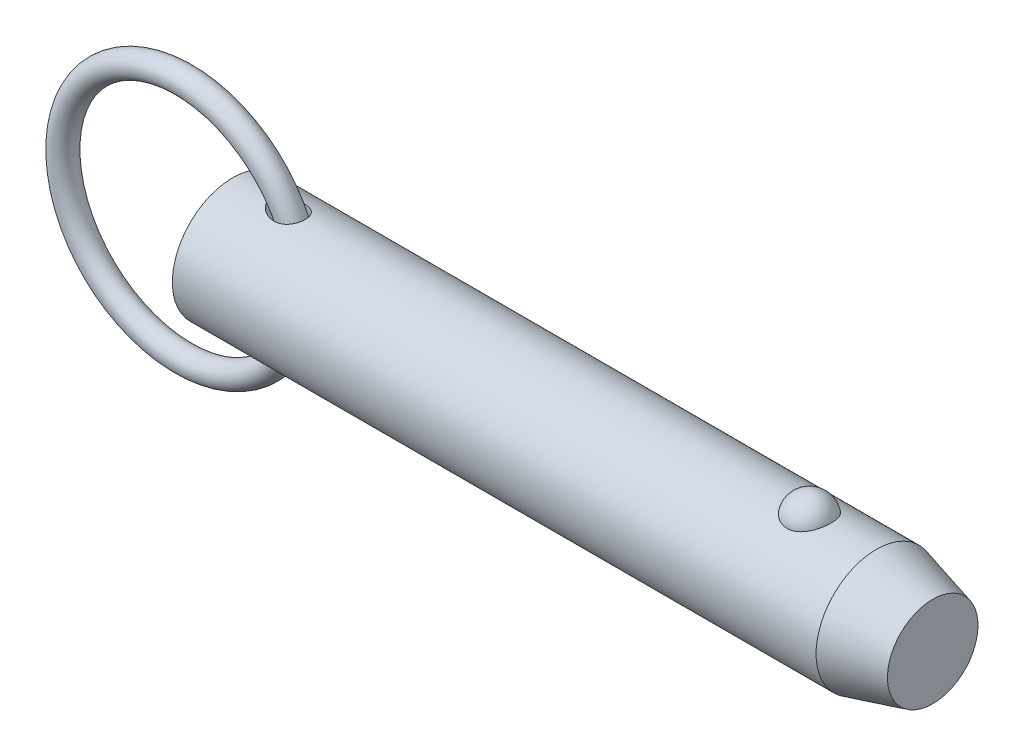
ISO-10303-21;
HEADER;
FILE_DESCRIPTION(('STEP AP214'),'2;1');
FILE_NAME('part.step','',(''),(''),'','','');
FILE_SCHEMA(('AUTOMOTIVE_DESIGN { 1 0 10303 214 1 1 1 1 }'));
ENDSEC;
DATA;
#1=APPLICATION_CONTEXT('core data for automotive mechanical design processes');
#2=APPLICATION_PROTOCOL_DEFINITION('international standard','automotive_design',2000,#1);
#3=PRODUCT_CONTEXT('',#1,'mechanical');
#4=PRODUCT('Part','Part','',(#3));
#5=PRODUCT_RELATED_PRODUCT_CATEGORY('part','',(#4));
#6=PRODUCT_DEFINITION_FORMATION('','',#4);
#7=PRODUCT_DEFINITION_CONTEXT('part definition',#1,'design');
#8=PRODUCT_DEFINITION('design','',#6,#7);
#9=PRODUCT_DEFINITION_SHAPE('','',#8);
#10=(LENGTH_UNIT() NAMED_UNIT(*) SI_UNIT(.MILLI.,.METRE.));
#11=(NAMED_UNIT(*) PLANE_ANGLE_UNIT() SI_UNIT($,.RADIAN.));
#12=(NAMED_UNIT(*) SI_UNIT($,.STERADIAN.) SOLID_ANGLE_UNIT());
#13=UNCERTAINTY_MEASURE_WITH_UNIT(LENGTH_MEASURE(1.E-05),#10,'distance_accuracy_value','');
#14=(GEOMETRIC_REPRESENTATION_CONTEXT(3) GLOBAL_UNCERTAINTY_ASSIGNED_CONTEXT((#13)) GLOBAL_UNIT_ASSIGNED_CONTEXT((#10,
#11,#12)) REPRESENTATION_CONTEXT('',''));
#15=CARTESIAN_POINT('',(0.,0.,0.));
#16=DIRECTION('',(0.,0.,1.));
#17=DIRECTION('',(1.,0.,0.));
#18=AXIS2_PLACEMENT_3D('',#15,#16,#17);
#19=CARTESIAN_POINT('',(-6.46799987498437,0.,0.));
#20=DIRECTION('',(0.,0.,1.));
#21=DIRECTION('',(1.,0.,0.));
#22=AXIS2_PLACEMENT_3D('',#19,#20,#21);
#23=TOROIDAL_SURFACE('',#22,15.875,1.588);
#24=CARTESIAN_POINT('',(10.9950001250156,0.,0.));
#25=VERTEX_POINT('',#24);
#26=VERTEX_LOOP('',#25);
#27=FACE_BOUND('',#26,.T.);
#28=ADVANCED_FACE('P0_F12',(#27),#23,.T.);
#29=CLOSED_SHELL('',(#28));
#30=MANIFOLD_SOLID_BREP('P0_B1',#29);
#31=CARTESIAN_POINT('',(0.,0.,0.));
#32=DIRECTION('',(1.,0.,0.));
#33=DIRECTION('',(0.,0.,-1.));
#34=AXIS2_PLACEMENT_3D('',#31,#32,#33);
#35=CYLINDRICAL_SURFACE('',#34,7.94);
#36=CARTESIAN_POINT('',(5.37881269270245,7.8641200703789,-1.0950869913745));
#37=CARTESIAN_POINT('',(5.49078530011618,7.84653010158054,-1.22142628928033));
#38=CARTESIAN_POINT('',(5.61742164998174,7.82766483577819,-1.33478448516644));
#39=CARTESIAN_POINT('',(5.82155225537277,7.80005811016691,-1.48501770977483));
#40=CARTESIAN_POINT('',(5.89211597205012,7.79095331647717,-1.53186949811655));
#41=CARTESIAN_POINT('',(6.03726296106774,7.77331484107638,-1.61899652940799));
#42=CARTESIAN_POINT('',(6.11184478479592,7.76478095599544,-1.65927412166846));
#43=CARTESIAN_POINT('',(6.31831542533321,7.74290334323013,-1.75933205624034));
#44=CARTESIAN_POINT('',(6.45343253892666,7.73042593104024,-1.81276183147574));
#45=CARTESIAN_POINT('',(6.73017339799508,7.70966096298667,-1.89912673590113));
#46=CARTESIAN_POINT('',(6.8717909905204,7.70136953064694,-1.93208083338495));
#47=CARTESIAN_POINT('',(7.17522096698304,7.6896684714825,-1.97820987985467));
#48=CARTESIAN_POINT('',(7.33750100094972,7.68691980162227,-1.98871513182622));
#49=CARTESIAN_POINT('',(7.5799424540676,7.68880305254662,-1.98137951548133));
#50=CARTESIAN_POINT('',(7.66059155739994,7.69043175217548,-1.97508575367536));
#51=CARTESIAN_POINT('',(7.82077465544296,7.69570110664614,-1.95445819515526));
#52=CARTESIAN_POINT('',(7.9003091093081,7.69934090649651,-1.94012781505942));
#53=CARTESIAN_POINT('',(8.09280087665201,7.71066069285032,-1.89475688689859));
#54=CARTESIAN_POINT('',(8.20465204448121,7.71942251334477,-1.85909462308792));
#55=CARTESIAN_POINT('',(8.42059371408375,7.74035594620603,-1.7699066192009));
#56=CARTESIAN_POINT('',(8.52468939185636,7.75252525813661,-1.7163929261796));
#57=CARTESIAN_POINT('',(8.72211003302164,7.77903750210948,-1.59192358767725));
#58=CARTESIAN_POINT('',(8.81539818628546,7.79338749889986,-1.52091076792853));
#59=CARTESIAN_POINT('',(8.98759177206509,7.8225086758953,-1.36321590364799));
#60=CARTESIAN_POINT('',(9.06649712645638,7.83727985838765,-1.27653377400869));
#61=CARTESIAN_POINT('',(9.20311499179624,7.86453692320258,-1.09567667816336));
#62=CARTESIAN_POINT('',(9.26180839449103,7.8771064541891,-1.00225329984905));
#63=CARTESIAN_POINT('',(9.36257622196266,7.89954213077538,-0.806547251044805));
#64=CARTESIAN_POINT('',(9.40465301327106,7.9094086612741,-0.704265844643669));
#65=CARTESIAN_POINT('',(9.47062404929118,7.92520709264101,-0.495461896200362));
#66=CARTESIAN_POINT('',(9.4947881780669,7.9311972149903,-0.389028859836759));
#67=CARTESIAN_POINT('',(9.52544004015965,7.93883641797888,-0.173494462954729));
#68=CARTESIAN_POINT('',(9.53192786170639,7.94048552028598,-0.0643931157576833));
#69=CARTESIAN_POINT('',(9.52707996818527,7.93926454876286,0.153487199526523));
#70=CARTESIAN_POINT('',(9.51572796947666,7.93639034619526,0.262265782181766));
#71=CARTESIAN_POINT('',(9.47542322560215,7.92642470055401,0.47631311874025));
#72=CARTESIAN_POINT('',(9.44647056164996,7.91933327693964,0.581581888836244));
#73=CARTESIAN_POINT('',(9.3716401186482,7.90170355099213,0.78560269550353));
#74=CARTESIAN_POINT('',(9.32576415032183,7.89116561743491,0.884355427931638));
#75=CARTESIAN_POINT('',(9.21823065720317,7.8677977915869,1.07254831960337));
#76=CARTESIAN_POINT('',(9.15657431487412,7.85496807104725,1.16198917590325));
#77=CARTESIAN_POINT('',(9.01919194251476,7.82843688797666,1.32903649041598));
#78=CARTESIAN_POINT('',(8.94347744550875,7.81473614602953,1.40665255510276));
#79=CARTESIAN_POINT('',(8.78012086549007,7.7879321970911,1.54819779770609));
#80=CARTESIAN_POINT('',(8.69247914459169,7.77482897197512,1.61212739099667));
#81=CARTESIAN_POINT('',(8.50642314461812,7.75037063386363,1.72592270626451));
#82=CARTESIAN_POINT('',(8.40786430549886,7.73904540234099,1.77555777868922));
#83=CARTESIAN_POINT('',(8.2039870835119,7.71943979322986,1.85894844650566));
#84=CARTESIAN_POINT('',(8.0986670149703,7.7111601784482,1.89270006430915));
#85=CARTESIAN_POINT('',(7.87703213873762,7.69782475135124,1.94625652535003));
#86=CARTESIAN_POINT('',(7.76044899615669,7.69301557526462,1.96500324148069));
#87=CARTESIAN_POINT('',(7.52574256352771,7.68770484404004,1.98567257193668));
#88=CARTESIAN_POINT('',(7.40761868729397,7.68720497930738,1.98758858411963));
#89=CARTESIAN_POINT('',(7.15639592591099,7.69044495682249,1.97502233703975));
#90=CARTESIAN_POINT('',(7.02341871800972,7.69476380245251,1.9583009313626));
#91=CARTESIAN_POINT('',(6.7612589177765,7.70776394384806,1.90648094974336));
#92=CARTESIAN_POINT('',(6.6320804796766,7.71644984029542,1.87136299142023));
#93=CARTESIAN_POINT('',(6.35978215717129,7.73875442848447,1.7770773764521));
#94=CARTESIAN_POINT('',(6.21772122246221,7.75293863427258,1.71496895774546));
#95=CARTESIAN_POINT('',(5.94559201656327,7.78383102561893,1.56880760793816));
#96=CARTESIAN_POINT('',(5.81552062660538,7.80053855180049,1.48476040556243));
#97=CARTESIAN_POINT('',(5.60081087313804,7.83035955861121,1.31701356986));
#98=CARTESIAN_POINT('',(5.51265224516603,7.84340226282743,1.23780647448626));
#99=CARTESIAN_POINT('',(5.34976240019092,7.86852524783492,1.06647953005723));
#100=CARTESIAN_POINT('',(5.27500719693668,7.88060722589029,0.974383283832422));
#101=CARTESIAN_POINT('',(5.15877594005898,7.89990441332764,0.800548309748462));
#102=CARTESIAN_POINT('',(5.11360209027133,7.90759876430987,0.721348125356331));
#103=CARTESIAN_POINT('',(5.03655060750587,7.92090267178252,0.556518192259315));
#104=CARTESIAN_POINT('',(5.00466157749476,7.92651401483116,0.470894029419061));
#105=CARTESIAN_POINT('',(4.95653766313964,7.93503671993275,0.294356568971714));
#106=CARTESIAN_POINT('',(4.94043621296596,7.93792505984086,0.203404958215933));
#107=CARTESIAN_POINT('',(4.92605720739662,7.94050250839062,0.0200631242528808));
#108=CARTESIAN_POINT('',(4.92776929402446,7.9401934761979,-0.0723262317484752));
#109=CARTESIAN_POINT('',(4.94742735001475,7.93667454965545,-0.243250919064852));
#110=CARTESIAN_POINT('',(4.96327131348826,7.93384031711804,-0.322048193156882));
#111=CARTESIAN_POINT('',(5.00707570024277,7.92609115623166,-0.476058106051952));
#112=CARTESIAN_POINT('',(5.03503965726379,7.92117562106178,-0.551269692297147));
#113=CARTESIAN_POINT('',(5.10737112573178,7.90866290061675,-0.709995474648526));
#114=CARTESIAN_POINT('',(5.15379379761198,7.90074105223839,-0.792541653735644));
#115=CARTESIAN_POINT('',(5.2582083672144,7.88338732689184,-0.949781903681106));
#116=CARTESIAN_POINT('',(5.31621941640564,7.87395295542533,-1.02446265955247));
#117=CARTESIAN_POINT('',(5.37881269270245,7.8641200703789,-1.0950869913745));
#118=B_SPLINE_CURVE_WITH_KNOTS('',3,(#36,#37,#38,#39,#40,#41,#42,#43,#44,#45,#46,#47,#48,#49,
#50,#51,#52,#53,#54,#55,#56,#57,#58,#59,#60,#61,#62,#63,#64,#65,#66,#67,#68,#69,#70,#71,#72,#73,
#74,#75,#76,#77,#78,#79,#80,#81,#82,#83,#84,#85,#86,#87,#88,#89,#90,#91,#92,#93,#94,#95,#96,#97,
#98,#99,#100,#101,#102,#103,#104,#105,#106,#107,#108,#109,#110,#111,#112,#113,#114,#115,#116,
#117),.UNSPECIFIED.,.T.,.F.,(4,2,2,2,2,2,2,2,2,2,2,2,2,2,2,2,2,2,2,2,2,2,2,2,2,2,2,2,2,2,2,2,2,
2,2,2,2,2,2,2,4),(0.,0.508599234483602,0.763935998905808,1.01918131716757,1.45492798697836,
1.89027038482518,2.37502798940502,2.61739702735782,2.8596631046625,3.21120678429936,
3.56251370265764,3.91498401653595,4.26745624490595,4.59897839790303,4.93045331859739,
5.25682643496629,5.58319792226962,5.909867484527,6.23653553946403,6.56316865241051,
6.88977729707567,7.21611917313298,7.54245114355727,7.87378632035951,8.20520442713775,
8.55832700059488,8.91158808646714,9.31234018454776,9.71351536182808,10.1786231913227,
10.6436096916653,11.0001264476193,11.3559986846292,11.6294791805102,11.9027245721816,
12.1782599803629,12.4536351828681,12.693828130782,12.9340911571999,13.2179277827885,
13.5022374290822),.UNSPECIFIED.);
#119=CARTESIAN_POINT('',(5.37881269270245,7.8641200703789,-1.0950869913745));
#120=VERTEX_POINT('',#119);
#121=EDGE_CURVE('P1_E40',#120,#120,#118,.T.);
#122=ORIENTED_EDGE('',*,*,#121,.T.);
#123=EDGE_LOOP('',(#122));
#124=FACE_BOUND('',#123,.T.);
#125=CARTESIAN_POINT('',(84.6718791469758,0.,0.));
#126=DIRECTION('',(1.,0.,0.));
#127=DIRECTION('',(0.,0.,-1.));
#128=AXIS2_PLACEMENT_3D('',#125,#126,#127);
#129=CIRCLE('',#128,7.94);
#130=CARTESIAN_POINT('',(84.6718791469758,0.,-7.94));
#131=VERTEX_POINT('',#130);
#132=EDGE_CURVE('P1_E25',#131,#131,#129,.T.);
#133=ORIENTED_EDGE('',*,*,#132,.F.);
#134=EDGE_LOOP('',(#133));
#135=FACE_BOUND('',#134,.T.);
#136=CARTESIAN_POINT('',(0.,0.,0.));
#137=DIRECTION('',(1.,0.,0.));
#138=DIRECTION('',(0.,0.,-1.));
#139=AXIS2_PLACEMENT_3D('',#136,#137,#138);
#140=CIRCLE('',#139,7.94);
#141=CARTESIAN_POINT('',(0.,0.,-7.94));
#142=VERTEX_POINT('',#141);
#143=EDGE_CURVE('P1_E9',#142,#142,#140,.T.);
#144=ORIENTED_EDGE('',*,*,#143,.T.);
#145=EDGE_LOOP('',(#144));
#146=FACE_BOUND('',#145,.T.);
#147=CARTESIAN_POINT('',(75.8649074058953,7.37767842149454,2.93486986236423));
#148=CARTESIAN_POINT('',(75.7127496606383,7.3776732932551,2.93487505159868));
#149=CARTESIAN_POINT('',(75.5606329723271,7.38258419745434,2.92262454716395));
#150=CARTESIAN_POINT('',(75.2609284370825,7.40163229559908,2.87404196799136));
#151=CARTESIAN_POINT('',(75.1133394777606,7.41576720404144,2.83771585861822));
#152=CARTESIAN_POINT('',(74.8270187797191,7.4516157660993,2.74218769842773));
#153=CARTESIAN_POINT('',(74.6882745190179,7.47331841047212,2.68301886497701));
#154=CARTESIAN_POINT('',(74.4228822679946,7.52194082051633,2.54350967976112));
#155=CARTESIAN_POINT('',(74.2962366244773,7.5488615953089,2.46316523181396));
#156=CARTESIAN_POINT('',(74.0545349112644,7.60594671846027,2.28090375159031));
#157=CARTESIAN_POINT('',(73.9399065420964,7.63618114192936,2.17844211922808));
#158=CARTESIAN_POINT('',(73.7288787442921,7.69614046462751,1.95608495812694));
#159=CARTESIAN_POINT('',(73.6324826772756,7.72586526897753,1.83618622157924));
#160=CARTESIAN_POINT('',(73.4559381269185,7.78314821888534,1.57628086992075));
#161=CARTESIAN_POINT('',(73.3767072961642,7.81055035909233,1.43561546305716));
#162=CARTESIAN_POINT('',(73.2417979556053,7.85879631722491,1.14236334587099));
#163=CARTESIAN_POINT('',(73.1861216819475,7.87963951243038,0.989775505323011));
#164=CARTESIAN_POINT('',(73.0988121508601,7.91289645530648,0.674619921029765));
#165=CARTESIAN_POINT('',(73.0675309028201,7.925186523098,0.511941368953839));
#166=CARTESIAN_POINT('',(73.030975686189,7.93958930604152,0.183247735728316));
#167=CARTESIAN_POINT('',(73.0257012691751,7.94170219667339,0.0172327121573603));
#168=CARTESIAN_POINT('',(73.0412311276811,7.93554931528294,-0.312672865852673));
#169=CARTESIAN_POINT('',(73.0619253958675,7.92732732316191,-0.476569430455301));
#170=CARTESIAN_POINT('',(73.1287865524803,7.90141534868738,-0.798305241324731));
#171=CARTESIAN_POINT('',(73.1749539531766,7.88372517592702,-0.956144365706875));
#172=CARTESIAN_POINT('',(73.2918986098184,7.84066230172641,-1.26152073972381));
#173=CARTESIAN_POINT('',(73.3627046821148,7.81528060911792,-1.40904568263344));
#174=CARTESIAN_POINT('',(73.5274789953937,7.7594867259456,-1.68950598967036));
#175=CARTESIAN_POINT('',(73.6214488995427,7.72907417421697,-1.82244030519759));
#176=CARTESIAN_POINT('',(73.8308391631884,7.66640424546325,-2.07032792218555));
#177=CARTESIAN_POINT('',(73.9463152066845,7.63414223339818,-2.1852330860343));
#178=CARTESIAN_POINT('',(74.1959006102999,7.57149681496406,-2.39329737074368));
#179=CARTESIAN_POINT('',(74.3300080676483,7.54111321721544,-2.48645870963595));
#180=CARTESIAN_POINT('',(74.6101113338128,7.48650742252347,-2.64628132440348));
#181=CARTESIAN_POINT('',(74.7557605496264,7.46215900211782,-2.71350554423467));
#182=CARTESIAN_POINT('',(75.0574259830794,7.42171253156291,-2.82226614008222));
#183=CARTESIAN_POINT('',(75.2134383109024,7.40561140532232,-2.86381209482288));
#184=CARTESIAN_POINT('',(75.5229708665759,7.3842679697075,-2.91839077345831));
#185=CARTESIAN_POINT('',(75.6762229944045,7.37852109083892,-2.93275024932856));
#186=CARTESIAN_POINT('',(75.9830705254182,7.37700973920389,-2.93655208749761));
#187=CARTESIAN_POINT('',(76.1366658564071,7.38124333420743,-2.92599927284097));
#188=CARTESIAN_POINT('',(76.4349907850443,7.39890635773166,-2.88102897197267));
#189=CARTESIAN_POINT('',(76.5798480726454,7.41205491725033,-2.8473399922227));
#190=CARTESIAN_POINT('',(76.8616432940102,7.445801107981,-2.75788206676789));
#191=CARTESIAN_POINT('',(76.9985805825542,7.46639934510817,-2.70211132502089));
#192=CARTESIAN_POINT('',(77.2640619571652,7.51339098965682,-2.56858908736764));
#193=CARTESIAN_POINT('',(77.3923548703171,7.53990200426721,-2.49038067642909));
#194=CARTESIAN_POINT('',(77.6342440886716,7.59569503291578,-2.31462737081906));
#195=CARTESIAN_POINT('',(77.7478370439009,7.62497767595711,-2.21707808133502));
#196=CARTESIAN_POINT('',(77.96322156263,7.68489473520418,-1.99982049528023));
#197=CARTESIAN_POINT('',(78.0641488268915,7.71552419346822,-1.87925337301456));
#198=CARTESIAN_POINT('',(78.2451866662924,7.77353016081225,-1.62268826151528));
#199=CARTESIAN_POINT('',(78.3252934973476,7.80090608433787,-1.4866875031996));
#200=CARTESIAN_POINT('',(78.4653615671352,7.85047992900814,-1.19818413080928));
#201=CARTESIAN_POINT('',(78.5245877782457,7.8724818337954,-1.04529016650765));
#202=CARTESIAN_POINT('',(78.6179821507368,7.90785114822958,-0.731080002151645));
#203=CARTESIAN_POINT('',(78.6521497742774,7.92121837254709,-0.569763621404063));
#204=CARTESIAN_POINT('',(78.694795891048,7.93797834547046,-0.242812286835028));
#205=CARTESIAN_POINT('',(78.7032047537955,7.94134405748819,-0.0771668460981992));
#206=CARTESIAN_POINT('',(78.6939626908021,7.93767937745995,0.253276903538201));
#207=CARTESIAN_POINT('',(78.6763120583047,7.93064910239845,0.41807522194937));
#208=CARTESIAN_POINT('',(78.615424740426,7.90695571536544,0.741525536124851));
#209=CARTESIAN_POINT('',(78.5722819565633,7.8903279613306,0.900197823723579));
#210=CARTESIAN_POINT('',(78.4613535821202,7.84916386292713,1.20759654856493));
#211=CARTESIAN_POINT('',(78.39356656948,7.82462706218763,1.35632241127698));
#212=CARTESIAN_POINT('',(78.2343718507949,7.7700669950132,1.64032869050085));
#213=CARTESIAN_POINT('',(78.1428616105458,7.7400200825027,1.77554712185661));
#214=CARTESIAN_POINT('',(77.9382960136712,7.67774175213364,2.02800648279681));
#215=CARTESIAN_POINT('',(77.8252410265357,7.64551037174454,2.14524772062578));
#216=CARTESIAN_POINT('',(77.5808318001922,7.58265895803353,2.35778002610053));
#217=CARTESIAN_POINT('',(77.4495833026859,7.5520309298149,2.45319004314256));
#218=CARTESIAN_POINT('',(77.171601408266,7.49579792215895,2.61999897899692));
#219=CARTESIAN_POINT('',(77.0248670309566,7.47019326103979,2.69139637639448));
#220=CARTESIAN_POINT('',(76.7129477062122,7.42622216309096,2.8105324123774));
#221=CARTESIAN_POINT('',(76.5472209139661,7.40825002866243,2.85700910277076));
#222=CARTESIAN_POINT('',(76.2092792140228,7.38398348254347,2.9191685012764));
#223=CARTESIAN_POINT('',(76.0370670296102,7.3776842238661,2.93486399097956));
#224=CARTESIAN_POINT('',(75.8649074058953,7.37767842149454,2.93486986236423));
#225=B_SPLINE_CURVE_WITH_KNOTS('',3,(#147,#148,#149,#150,#151,#152,#153,#154,#155,#156,#157,
#158,#159,#160,#161,#162,#163,#164,#165,#166,#167,#168,#169,#170,#171,#172,#173,#174,#175,#176,
#177,#178,#179,#180,#181,#182,#183,#184,#185,#186,#187,#188,#189,#190,#191,#192,#193,#194,#195,
#196,#197,#198,#199,#200,#201,#202,#203,#204,#205,#206,#207,#208,#209,#210,#211,#212,#213,#214,
#215,#216,#217,#218,#219,#220,#221,#222,#223,#224),.UNSPECIFIED.,.T.,.F.,(4,2,2,2,2,2,2,2,2,2,2,
2,2,2,2,2,2,2,2,2,2,2,2,2,2,2,2,2,2,2,2,2,2,2,2,2,2,2,4),(0.,0.45584132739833,0.911569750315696,
1.36663794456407,1.8217942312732,2.28978983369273,2.7578716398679,3.246853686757,
3.73588214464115,4.23184282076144,4.72779494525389,5.22165321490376,5.71552141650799,
6.20996917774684,6.70445245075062,7.20023431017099,7.69596557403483,8.18023418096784,
8.66432203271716,9.12410697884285,9.58380291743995,10.0296503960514,10.4755341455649,
10.9312349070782,11.3870393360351,11.8654416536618,12.3439299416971,12.8378875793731,
13.3318558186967,13.8271581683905,14.3224549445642,14.8159385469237,15.3094506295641,
15.8051323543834,16.3008055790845,16.7937101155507,17.2866458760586,17.8026240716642,
18.3183879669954),.UNSPECIFIED.);
#226=CARTESIAN_POINT('',(75.8649074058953,7.37767842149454,2.93486986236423));
#227=VERTEX_POINT('',#226);
#228=EDGE_CURVE('P1_E34',#227,#227,#225,.T.);
#229=ORIENTED_EDGE('',*,*,#228,.T.);
#230=EDGE_LOOP('',(#229));
#231=FACE_BOUND('',#230,.T.);
#232=CARTESIAN_POINT('',(5.37881269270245,-7.8641200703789,-1.0950869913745));
#233=CARTESIAN_POINT('',(5.31532711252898,-7.87409326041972,-1.02345575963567));
#234=CARTESIAN_POINT('',(5.25654962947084,-7.88365715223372,-0.947641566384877));
#235=CARTESIAN_POINT('',(5.15093536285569,-7.90122221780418,-0.787865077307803));
#236=CARTESIAN_POINT('',(5.10408931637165,-7.90922460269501,-0.703909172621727));
#237=CARTESIAN_POINT('',(5.02499142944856,-7.92292057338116,-0.527991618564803));
#238=CARTESIAN_POINT('',(4.99290048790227,-7.92858863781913,-0.435954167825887));
#239=CARTESIAN_POINT('',(4.94718343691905,-7.93670712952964,-0.247266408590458));
#240=CARTESIAN_POINT('',(4.93353142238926,-7.93916207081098,-0.150622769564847));
#241=CARTESIAN_POINT('',(4.92669426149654,-7.94038957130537,0.0306459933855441));
#242=CARTESIAN_POINT('',(4.9310562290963,-7.93960347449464,0.115182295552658));
#243=CARTESIAN_POINT('',(4.95441758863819,-7.93542535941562,0.282133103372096));
#244=CARTESIAN_POINT('',(4.97342060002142,-7.93203269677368,0.364547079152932));
#245=CARTESIAN_POINT('',(5.02337664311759,-7.92322764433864,0.521528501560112));
#246=CARTESIAN_POINT('',(5.05377582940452,-7.91790920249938,0.596281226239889));
#247=CARTESIAN_POINT('',(5.1246872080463,-7.90571364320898,0.740640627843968));
#248=CARTESIAN_POINT('',(5.16520358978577,-7.89883588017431,0.810245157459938));
#249=CARTESIAN_POINT('',(5.27792634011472,-7.88012470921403,0.978620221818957));
#250=CARTESIAN_POINT('',(5.35563200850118,-7.86757912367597,1.07363778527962));
#251=CARTESIAN_POINT('',(5.52523836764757,-7.84150676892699,1.24994147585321));
#252=CARTESIAN_POINT('',(5.61717506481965,-7.82797755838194,1.33119164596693));
#253=CARTESIAN_POINT('',(5.83913717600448,-7.79742756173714,1.50104748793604));
#254=CARTESIAN_POINT('',(5.97257429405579,-7.78050347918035,1.58521567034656));
#255=CARTESIAN_POINT('',(6.25160600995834,-7.74942135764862,1.73078109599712));
#256=CARTESIAN_POINT('',(6.39720857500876,-7.73526515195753,1.79216327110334));
#257=CARTESIAN_POINT('',(6.69793322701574,-7.7116170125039,1.8913447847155));
#258=CARTESIAN_POINT('',(6.85312134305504,-7.70216275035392,1.92895428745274));
#259=CARTESIAN_POINT('',(7.16781951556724,-7.68988337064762,1.97736316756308));
#260=CARTESIAN_POINT('',(7.32732244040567,-7.68704791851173,1.98820434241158));
#261=CARTESIAN_POINT('',(7.61290770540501,-7.68890797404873,1.98097687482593));
#262=CARTESIAN_POINT('',(7.73913797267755,-7.69217875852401,1.96837928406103));
#263=CARTESIAN_POINT('',(7.98774248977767,-7.70364253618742,1.92303262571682));
#264=CARTESIAN_POINT('',(8.11011880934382,-7.71183283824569,1.89029457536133));
#265=CARTESIAN_POINT('',(8.34766306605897,-7.73253074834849,1.80375920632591));
#266=CARTESIAN_POINT('',(8.46278682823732,-7.74506226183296,1.74984505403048));
#267=CARTESIAN_POINT('',(8.68062682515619,-7.77294147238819,1.62149891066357));
#268=CARTESIAN_POINT('',(8.78334736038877,-7.78828818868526,1.54707406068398));
#269=CARTESIAN_POINT('',(8.9627595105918,-7.81808719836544,1.38814746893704));
#270=CARTESIAN_POINT('',(9.04102925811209,-7.83247448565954,1.30540890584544));
#271=CARTESIAN_POINT('',(9.18176824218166,-7.86008608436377,1.12727331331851));
#272=CARTESIAN_POINT('',(9.24424163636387,-7.87331070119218,1.03187962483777));
#273=CARTESIAN_POINT('',(9.34924815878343,-7.89649032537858,0.835684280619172));
#274=CARTESIAN_POINT('',(9.39252490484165,-7.90656172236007,0.735293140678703));
#275=CARTESIAN_POINT('',(9.46188913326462,-7.92307290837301,0.528458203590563));
#276=CARTESIAN_POINT('',(9.48797767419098,-7.92951292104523,0.422014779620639));
#277=CARTESIAN_POINT('',(9.5222867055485,-7.93804067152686,0.206589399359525));
#278=CARTESIAN_POINT('',(9.53058328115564,-7.94014694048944,0.0976202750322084));
#279=CARTESIAN_POINT('',(9.52935292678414,-7.93983698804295,-0.120212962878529));
#280=CARTESIAN_POINT('',(9.51982577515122,-7.9374207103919,-0.229077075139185));
#281=CARTESIAN_POINT('',(9.48313466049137,-7.92831916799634,-0.443751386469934));
#282=CARTESIAN_POINT('',(9.45594838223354,-7.92162850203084,-0.549557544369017));
#283=CARTESIAN_POINT('',(9.3845465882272,-7.90469917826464,-0.754954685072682));
#284=CARTESIAN_POINT('',(9.34033171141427,-7.89446065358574,-0.854545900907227));
#285=CARTESIAN_POINT('',(9.23602927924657,-7.87157146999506,-1.04456732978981));
#286=CARTESIAN_POINT('',(9.17596171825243,-7.85892385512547,-1.13500888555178));
#287=CARTESIAN_POINT('',(9.04153430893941,-7.83259746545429,-1.30436780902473));
#288=CARTESIAN_POINT('',(8.96717562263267,-7.81891877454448,-1.38328611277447));
#289=CARTESIAN_POINT('',(8.80603455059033,-7.79196869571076,-1.52782923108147));
#290=CARTESIAN_POINT('',(8.71921490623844,-7.77869867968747,-1.59341269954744));
#291=CARTESIAN_POINT('',(8.53589430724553,-7.7539823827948,-1.70964937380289));
#292=CARTESIAN_POINT('',(8.439392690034,-7.74253622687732,-1.76030155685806));
#293=CARTESIAN_POINT('',(8.23614706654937,-7.72219212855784,-1.84754820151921));
#294=CARTESIAN_POINT('',(8.12916866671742,-7.71339202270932,-1.88361685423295));
#295=CARTESIAN_POINT('',(7.91082287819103,-7.69955300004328,-1.93940887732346));
#296=CARTESIAN_POINT('',(7.79945379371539,-7.69451555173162,-1.95912586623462));
#297=CARTESIAN_POINT('',(7.56409927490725,-7.6881073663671,-1.98413612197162));
#298=CARTESIAN_POINT('',(7.4399374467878,-7.68713944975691,-1.98784574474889));
#299=CARTESIAN_POINT('',(7.19239878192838,-7.68969629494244,-1.97792309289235));
#300=CARTESIAN_POINT('',(7.06902225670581,-7.69322274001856,-1.96428432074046));
#301=CARTESIAN_POINT('',(6.80624991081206,-7.70498367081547,-1.91768089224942));
#302=CARTESIAN_POINT('',(6.66736121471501,-7.71386737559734,-1.88203087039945));
#303=CARTESIAN_POINT('',(6.39625444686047,-7.73551250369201,-1.79098714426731));
#304=CARTESIAN_POINT('',(6.26404857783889,-7.74828074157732,-1.73555871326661));
#305=CARTESIAN_POINT('',(6.06559048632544,-7.77003865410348,-1.63446133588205));
#306=CARTESIAN_POINT('',(5.99591479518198,-7.77821880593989,-1.59522999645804));
#307=CARTESIAN_POINT('',(5.86025875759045,-7.79503524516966,-1.51091846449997));
#308=CARTESIAN_POINT('',(5.79427944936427,-7.8036716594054,-1.46583664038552));
#309=CARTESIAN_POINT('',(5.60322733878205,-7.82978128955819,-1.3219827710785));
#310=CARTESIAN_POINT('',(5.48449649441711,-7.84751780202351,-1.21433077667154));
#311=CARTESIAN_POINT('',(5.37881269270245,-7.8641200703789,-1.0950869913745));
#312=B_SPLINE_CURVE_WITH_KNOTS('',3,(#232,#233,#234,#235,#236,#237,#238,#239,#240,#241,#242,
#243,#244,#245,#246,#247,#248,#249,#250,#251,#252,#253,#254,#255,#256,#257,#258,#259,#260,#261,
#262,#263,#264,#265,#266,#267,#268,#269,#270,#271,#272,#273,#274,#275,#276,#277,#278,#279,#280,
#281,#282,#283,#284,#285,#286,#287,#288,#289,#290,#291,#292,#293,#294,#295,#296,#297,#298,#299,
#300,#301,#302,#303,#304,#305,#306,#307,#308,#309,#310,#311),.UNSPECIFIED.,.T.,.F.,(4,2,2,2,2,2,
2,2,2,2,2,2,2,2,2,2,2,2,2,2,2,2,2,2,2,2,2,2,2,2,2,2,2,2,2,2,2,2,2,4),(0.,0.288363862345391,
0.576503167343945,0.867714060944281,1.15851540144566,1.41111828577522,1.66378363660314,
1.90549406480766,2.1473047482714,2.51540453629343,2.88445136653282,3.3580515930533,
3.83196445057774,4.30961543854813,4.78652012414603,5.16565662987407,5.54458592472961,
5.92563591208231,6.30655339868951,6.6492078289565,6.99177197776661,7.31956587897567,
7.64733959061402,7.97370879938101,8.30008206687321,8.62686856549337,8.95364280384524,
9.28000684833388,9.60634436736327,9.93367879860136,10.261035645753,10.59932199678,
10.9377403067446,11.3089671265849,11.6803330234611,12.1096921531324,12.5398088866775,
12.7806650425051,13.0215885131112,13.5016249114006),.UNSPECIFIED.);
#313=CARTESIAN_POINT('',(5.37881269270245,-7.8641200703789,-1.0950869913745));
#314=VERTEX_POINT('',#313);
#315=EDGE_CURVE('P1_E17',#314,#314,#312,.T.);
#316=ORIENTED_EDGE('',*,*,#315,.T.);
#317=EDGE_LOOP('',(#316));
#318=FACE_BOUND('',#317,.T.);
#319=ADVANCED_FACE('P1_F13',(#124,#135,#146,#231,#318),#35,.T.);
#320=CARTESIAN_POINT('',(0.,0.,0.));
#321=DIRECTION('',(-1.,0.,0.));
#322=DIRECTION('',(0.,0.,1.));
#323=AXIS2_PLACEMENT_3D('',#320,#321,#322);
#324=PLANE('',#323);
#325=ORIENTED_EDGE('',*,*,#143,.F.);
#326=EDGE_LOOP('',(#325));
#327=FACE_BOUND('',#326,.T.);
#328=ADVANCED_FACE('P1_F15',(#327),#324,.T.);
#329=CARTESIAN_POINT('',(92.08,0.,0.));
#330=DIRECTION('',(-1.,0.,0.));
#331=DIRECTION('',(0.,0.,1.));
#332=AXIS2_PLACEMENT_3D('',#329,#330,#331);
#333=CONICAL_SURFACE('',#332,5.95500000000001,0.26179938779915);
#334=ORIENTED_EDGE('',*,*,#132,.T.);
#335=EDGE_LOOP('',(#334));
#336=FACE_BOUND('',#335,.T.);
#337=CARTESIAN_POINT('',(92.08,0.,0.));
#338=DIRECTION('',(1.,0.,0.));
#339=DIRECTION('',(0.,0.,-1.));
#340=AXIS2_PLACEMENT_3D('',#337,#338,#339);
#341=CIRCLE('',#340,5.95500000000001);
#342=CARTESIAN_POINT('',(92.08,0.,-5.95500000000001));
#343=VERTEX_POINT('',#342);
#344=EDGE_CURVE('P1_E30',#343,#343,#341,.T.);
#345=ORIENTED_EDGE('',*,*,#344,.F.);
#346=EDGE_LOOP('',(#345));
#347=FACE_BOUND('',#346,.T.);
#348=ADVANCED_FACE('P1_F55',(#336,#347),#333,.T.);
#349=CARTESIAN_POINT('',(92.08,5.95500000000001,0.));
#350=DIRECTION('',(1.,0.,0.));
#351=DIRECTION('',(0.,0.,-1.));
#352=AXIS2_PLACEMENT_3D('',#349,#350,#351);
#353=PLANE('',#352);
#354=ORIENTED_EDGE('',*,*,#344,.T.);
#355=EDGE_LOOP('',(#354));
#356=FACE_BOUND('',#355,.T.);
#357=ADVANCED_FACE('P1_F51',(#356),#353,.T.);
#358=CARTESIAN_POINT('',(75.8649074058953,7.146,0.));
#359=DIRECTION('',(-1.,0.,0.));
#360=DIRECTION('',(0.,1.,0.));
#361=AXIS2_PLACEMENT_3D('',#358,#359,#360);
#362=SPHERICAL_SURFACE('',#361,2.944);
#363=ORIENTED_EDGE('',*,*,#228,.F.);
#364=EDGE_LOOP('',(#363));
#365=FACE_BOUND('',#364,.T.);
#366=ADVANCED_FACE('P1_F46',(#365),#362,.T.);
#367=CARTESIAN_POINT('',(-6.46799987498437,0.,0.));
#368=DIRECTION('',(0.,0.,1.));
#369=DIRECTION('',(1.,0.,0.));
#370=AXIS2_PLACEMENT_3D('',#367,#368,#369);
#371=TOROIDAL_SURFACE('',#370,15.875,1.985);
#372=ORIENTED_EDGE('',*,*,#315,.F.);
#373=EDGE_LOOP('',(#372));
#374=FACE_BOUND('',#373,.T.);
#375=ORIENTED_EDGE('',*,*,#121,.F.);
#376=EDGE_LOOP('',(#375));
#377=FACE_BOUND('',#376,.T.);
#378=ADVANCED_FACE('P1_F50',(#374,#377),#371,.F.);
#379=CLOSED_SHELL('',(#319,#328,#348,#357,#366,#378));
#380=MANIFOLD_SOLID_BREP('P1_B1',#379);
#381=ADVANCED_BREP_SHAPE_REPRESENTATION('',(#18,#30,#380),#14);
#382=SHAPE_DEFINITION_REPRESENTATION(#9,#381);
ENDSEC;
END-ISO-10303-21;
